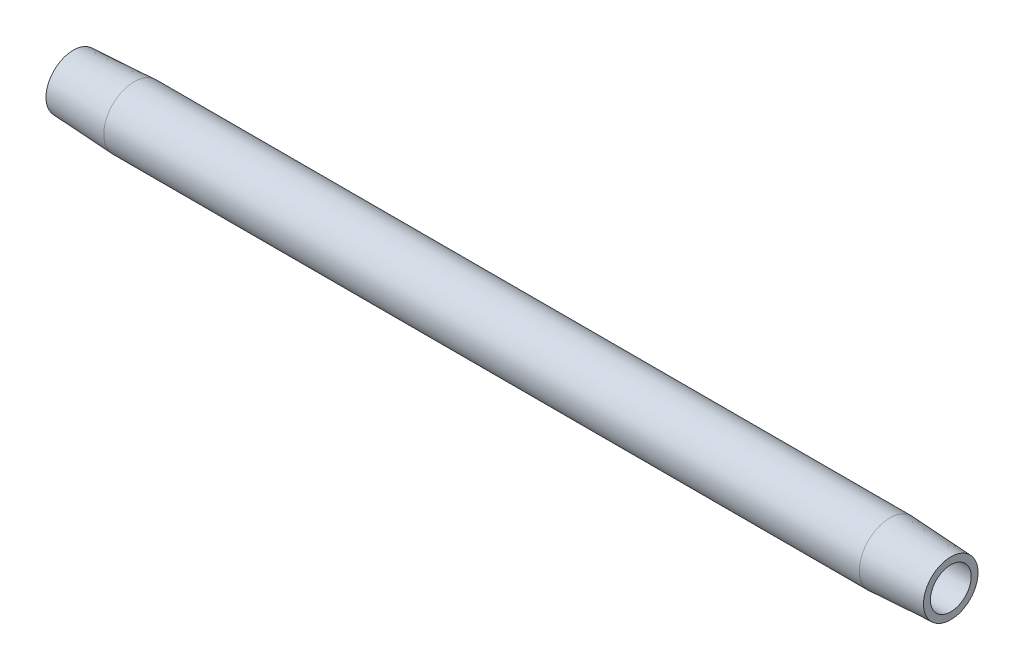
ISO-10303-21;
HEADER;
FILE_DESCRIPTION(('STEP AP214'),'2;1');
FILE_NAME('part.step','',(''),(''),'','','');
FILE_SCHEMA(('AUTOMOTIVE_DESIGN { 1 0 10303 214 1 1 1 1 }'));
ENDSEC;
DATA;
#1=APPLICATION_CONTEXT('core data for automotive mechanical design processes');
#2=APPLICATION_PROTOCOL_DEFINITION('international standard','automotive_design',2000,#1);
#3=PRODUCT_CONTEXT('',#1,'mechanical');
#4=PRODUCT('Part','Part','',(#3));
#5=PRODUCT_RELATED_PRODUCT_CATEGORY('part','',(#4));
#6=PRODUCT_DEFINITION_FORMATION('','',#4);
#7=PRODUCT_DEFINITION_CONTEXT('part definition',#1,'design');
#8=PRODUCT_DEFINITION('design','',#6,#7);
#9=PRODUCT_DEFINITION_SHAPE('','',#8);
#10=(LENGTH_UNIT() NAMED_UNIT(*) SI_UNIT(.MILLI.,.METRE.));
#11=(NAMED_UNIT(*) PLANE_ANGLE_UNIT() SI_UNIT($,.RADIAN.));
#12=(NAMED_UNIT(*) SI_UNIT($,.STERADIAN.) SOLID_ANGLE_UNIT());
#13=UNCERTAINTY_MEASURE_WITH_UNIT(LENGTH_MEASURE(1.E-05),#10,'distance_accuracy_value','');
#14=(GEOMETRIC_REPRESENTATION_CONTEXT(3) GLOBAL_UNCERTAINTY_ASSIGNED_CONTEXT((#13)) GLOBAL_UNIT_ASSIGNED_CONTEXT((#10,
#11,#12)) REPRESENTATION_CONTEXT('',''));
#15=CARTESIAN_POINT('',(0.,0.,0.));
#16=DIRECTION('',(0.,0.,1.));
#17=DIRECTION('',(1.,0.,0.));
#18=AXIS2_PLACEMENT_3D('',#15,#16,#17);
#19=CARTESIAN_POINT('',(0.476141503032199,0.,0.));
#20=DIRECTION('',(-1.,0.,0.));
#21=DIRECTION('',(0.,0.,1.));
#22=AXIS2_PLACEMENT_3D('',#19,#20,#21);
#23=CYLINDRICAL_SURFACE('',#22,3.96875);
#24=CARTESIAN_POINT('',(7.9375,0.,0.));
#25=DIRECTION('',(-1.,0.,0.));
#26=DIRECTION('',(0.,0.,1.));
#27=AXIS2_PLACEMENT_3D('',#24,#25,#26);
#28=CIRCLE('',#27,3.96875);
#29=CARTESIAN_POINT('',(7.9375,0.,3.96875));
#30=VERTEX_POINT('',#29);
#31=EDGE_CURVE('E10',#30,#30,#28,.T.);
#32=ORIENTED_EDGE('',*,*,#31,.F.);
#33=EDGE_LOOP('',(#32));
#34=FACE_BOUND('',#33,.T.);
#35=CARTESIAN_POINT('',(106.3625,0.,0.));
#36=DIRECTION('',(-1.,0.,0.));
#37=DIRECTION('',(0.,0.,1.));
#38=AXIS2_PLACEMENT_3D('',#35,#36,#37);
#39=CIRCLE('',#38,3.96875);
#40=CARTESIAN_POINT('',(106.3625,0.,3.96875));
#41=VERTEX_POINT('',#40);
#42=EDGE_CURVE('E52',#41,#41,#39,.T.);
#43=ORIENTED_EDGE('',*,*,#42,.T.);
#44=EDGE_LOOP('',(#43));
#45=FACE_BOUND('',#44,.T.);
#46=ADVANCED_FACE('F30',(#34,#45),#23,.T.);
#47=CARTESIAN_POINT('',(7.9375,0.,0.));
#48=DIRECTION('',(1.,0.,0.));
#49=DIRECTION('',(0.,0.,-1.));
#50=AXIS2_PLACEMENT_3D('',#47,#48,#49);
#51=CONICAL_SURFACE('',#50,3.96875,0.0523598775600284);
#52=CARTESIAN_POINT('',(0.,0.,0.));
#53=DIRECTION('',(-1.,0.,0.));
#54=DIRECTION('',(0.,0.,1.));
#55=AXIS2_PLACEMENT_3D('',#52,#53,#54);
#56=CIRCLE('',#55,3.55276325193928);
#57=CARTESIAN_POINT('',(0.,0.,3.55276325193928));
#58=VERTEX_POINT('',#57);
#59=EDGE_CURVE('E36',#58,#58,#56,.T.);
#60=ORIENTED_EDGE('',*,*,#59,.F.);
#61=EDGE_LOOP('',(#60));
#62=FACE_BOUND('',#61,.T.);
#63=ORIENTED_EDGE('',*,*,#31,.T.);
#64=EDGE_LOOP('',(#63));
#65=FACE_BOUND('',#64,.T.);
#66=ADVANCED_FACE('F77',(#62,#65),#51,.T.);
#67=CARTESIAN_POINT('',(0.,3.55276325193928,0.));
#68=DIRECTION('',(1.,0.,0.));
#69=DIRECTION('',(0.,0.,-1.));
#70=AXIS2_PLACEMENT_3D('',#67,#68,#69);
#71=PLANE('',#70);
#72=CARTESIAN_POINT('',(0.,0.,0.));
#73=DIRECTION('',(-1.,0.,0.));
#74=DIRECTION('',(0.,0.,1.));
#75=AXIS2_PLACEMENT_3D('',#72,#73,#74);
#76=CIRCLE('',#75,2.65429999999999);
#77=CARTESIAN_POINT('',(0.,0.,2.65429999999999));
#78=VERTEX_POINT('',#77);
#79=EDGE_CURVE('E40',#78,#78,#76,.T.);
#80=ORIENTED_EDGE('',*,*,#79,.F.);
#81=EDGE_LOOP('',(#80));
#82=FACE_BOUND('',#81,.T.);
#83=ORIENTED_EDGE('',*,*,#59,.T.);
#84=EDGE_LOOP('',(#83));
#85=FACE_BOUND('',#84,.T.);
#86=ADVANCED_FACE('F72',(#82,#85),#71,.F.);
#87=CARTESIAN_POINT('',(0.476141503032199,0.,0.));
#88=DIRECTION('',(-1.,0.,0.));
#89=DIRECTION('',(0.,0.,1.));
#90=AXIS2_PLACEMENT_3D('',#87,#88,#89);
#91=CYLINDRICAL_SURFACE('',#90,2.6543);
#92=CARTESIAN_POINT('',(114.3,0.,0.));
#93=DIRECTION('',(-1.,0.,0.));
#94=DIRECTION('',(0.,0.,1.));
#95=AXIS2_PLACEMENT_3D('',#92,#93,#94);
#96=CIRCLE('',#95,2.6543);
#97=CARTESIAN_POINT('',(114.3,0.,2.6543));
#98=VERTEX_POINT('',#97);
#99=EDGE_CURVE('E44',#98,#98,#96,.T.);
#100=ORIENTED_EDGE('',*,*,#99,.F.);
#101=EDGE_LOOP('',(#100));
#102=FACE_BOUND('',#101,.T.);
#103=ORIENTED_EDGE('',*,*,#79,.T.);
#104=EDGE_LOOP('',(#103));
#105=FACE_BOUND('',#104,.T.);
#106=ADVANCED_FACE('F66',(#102,#105),#91,.F.);
#107=CARTESIAN_POINT('',(114.3,2.6543,0.));
#108=DIRECTION('',(-1.,0.,0.));
#109=DIRECTION('',(0.,0.,1.));
#110=AXIS2_PLACEMENT_3D('',#107,#108,#109);
#111=PLANE('',#110);
#112=CARTESIAN_POINT('',(114.3,0.,0.));
#113=DIRECTION('',(-1.,0.,0.));
#114=DIRECTION('',(0.,0.,1.));
#115=AXIS2_PLACEMENT_3D('',#112,#113,#114);
#116=CIRCLE('',#115,3.55276325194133);
#117=CARTESIAN_POINT('',(114.3,0.,3.55276325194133));
#118=VERTEX_POINT('',#117);
#119=EDGE_CURVE('E49',#118,#118,#116,.T.);
#120=ORIENTED_EDGE('',*,*,#119,.F.);
#121=EDGE_LOOP('',(#120));
#122=FACE_BOUND('',#121,.T.);
#123=ORIENTED_EDGE('',*,*,#99,.T.);
#124=EDGE_LOOP('',(#123));
#125=FACE_BOUND('',#124,.T.);
#126=ADVANCED_FACE('F60',(#122,#125),#111,.F.);
#127=CARTESIAN_POINT('',(114.3,0.,0.));
#128=DIRECTION('',(-1.,0.,0.));
#129=DIRECTION('',(0.,0.,1.));
#130=AXIS2_PLACEMENT_3D('',#127,#128,#129);
#131=CONICAL_SURFACE('',#130,3.55276325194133,0.0523598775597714);
#132=ORIENTED_EDGE('',*,*,#42,.F.);
#133=EDGE_LOOP('',(#132));
#134=FACE_BOUND('',#133,.T.);
#135=ORIENTED_EDGE('',*,*,#119,.T.);
#136=EDGE_LOOP('',(#135));
#137=FACE_BOUND('',#136,.T.);
#138=ADVANCED_FACE('F57',(#134,#137),#131,.T.);
#139=CLOSED_SHELL('',(#46,#66,#86,#106,#126,#138));
#140=MANIFOLD_SOLID_BREP('B2',#139);
#141=ADVANCED_BREP_SHAPE_REPRESENTATION('',(#18,#140),#14);
#142=SHAPE_DEFINITION_REPRESENTATION(#9,#141);
ENDSEC;
END-ISO-10303-21;
